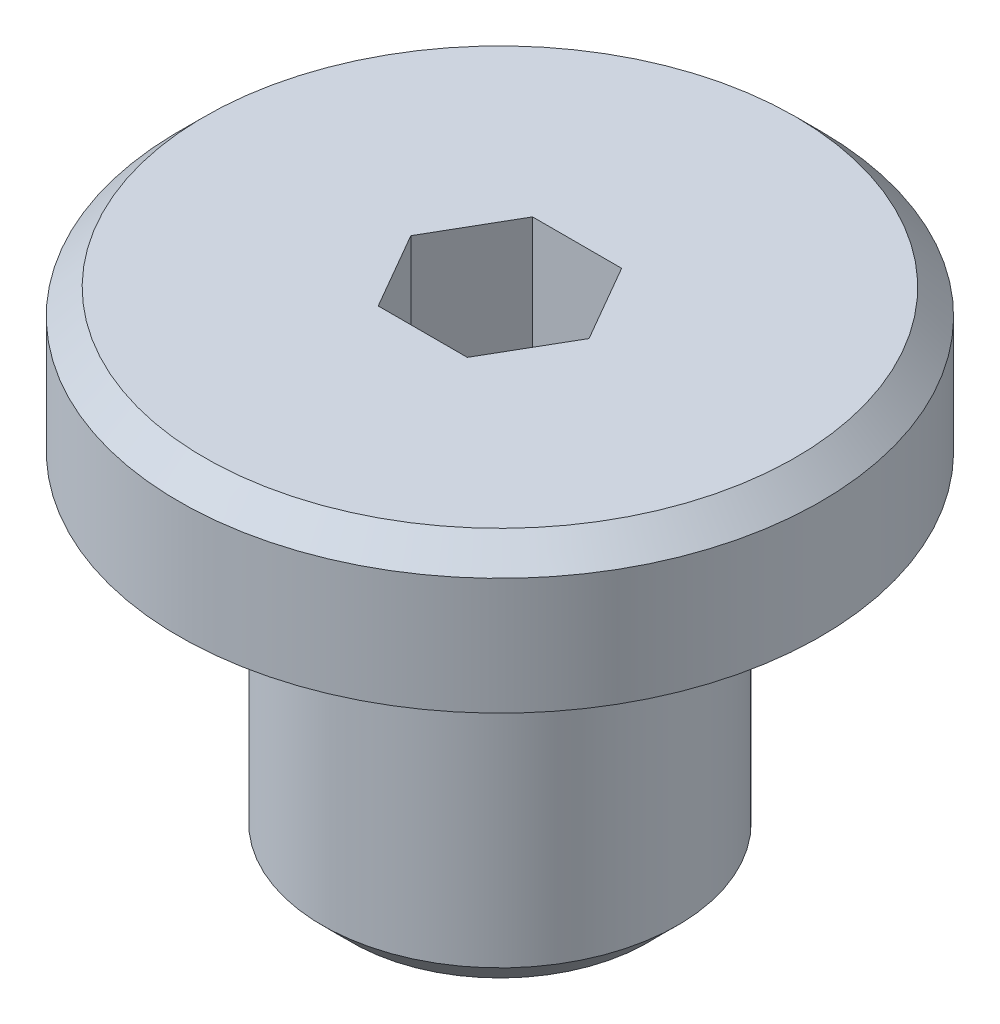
from build123d import *

# Parameters (mm, degrees)
CUT_EXTRUDE1_DEPTH = 4.445


with BuildPart() as part:
    # Sketch1 → Revolve1 (revolve)
    with BuildSketch(Plane(origin=(0, 0, 0), x_dir=(0, 0, -1), z_dir=(1, 0, 0))):
        with BuildLine():
            Line((5.1308, 0), (10.033, 0))
            Line((10.033, 0), (10.033, 3.65125))
            Line((10.033, 3.65125), (9.23925, 4.445))
            Line((9.23925, 4.445), (0, 4.445))
            Line((0, 4.445), (0, -10.9982))
            Line((0, -10.9982), (4.6228, -10.9982))
            Line((4.6228, -10.9982), (5.55625, -10.06475))
            Line((5.55625, -10.06475), (5.55625, -2.83845))
            Line((5.55625, -2.83845), (4.6228, -1.905))
            Line((4.6228, -1.905), (4.6228, -0.508))
            ThreePointArc((4.6228, -0.508), (4.771589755, -0.148789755), (5.1308, 0))
        make_face()
    revolve(axis=Axis((0, 0, 0), (0, 1, 0)))

    # Sketch6 → Cut-Extrude1 (cut)
    with BuildSketch(Plane(origin=(0, 4.445, 0), x_dir=(1, 0, 0), z_dir=(0, 1, 0))):
        Polygon((-1.3931462, 2.413), (-2.786292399, 0), (-1.3931462, -2.413), (1.3931462, -2.413), (2.786292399, 0), (1.3931462, 2.413), align=None)
    extrude(amount=-CUT_EXTRUDE1_DEPTH, mode=Mode.SUBTRACT)

    # Sketch9 → Groove for AS 568-015_ O-Ring1 (revolve, cut)
    with BuildSketch(Plane(origin=(0, 0, 0), x_dir=(0, 0, -1), z_dir=(-1, 0, 0)), mode=Mode.PRIVATE) as groove_for_as_568_015_o_ring1_sk:
        with BuildLine():
            Line((6.9977, -1.088937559), (6.902430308, 0))
            Line((6.902430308, 0), (9.734569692, 0))
            Line((9.734569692, 0), (9.6393, -1.088937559))
            ThreePointArc((9.6393, -1.088937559), (9.557866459, -1.254068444), (9.386266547, -1.3208))
            Line((9.386266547, -1.3208), (7.250733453, -1.3208))
            ThreePointArc((7.250733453, -1.3208), (7.079133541, -1.254068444), (6.9977, -1.088937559))
        make_face()
    revolve(groove_for_as_568_015_o_ring1_sk.sketch.rotate(Axis((0, -50, 0), (0, 1, 0)), 180), axis=Axis((0, -50, 0), (0, 1, 0)), mode=Mode.SUBTRACT)


solid = part.part
